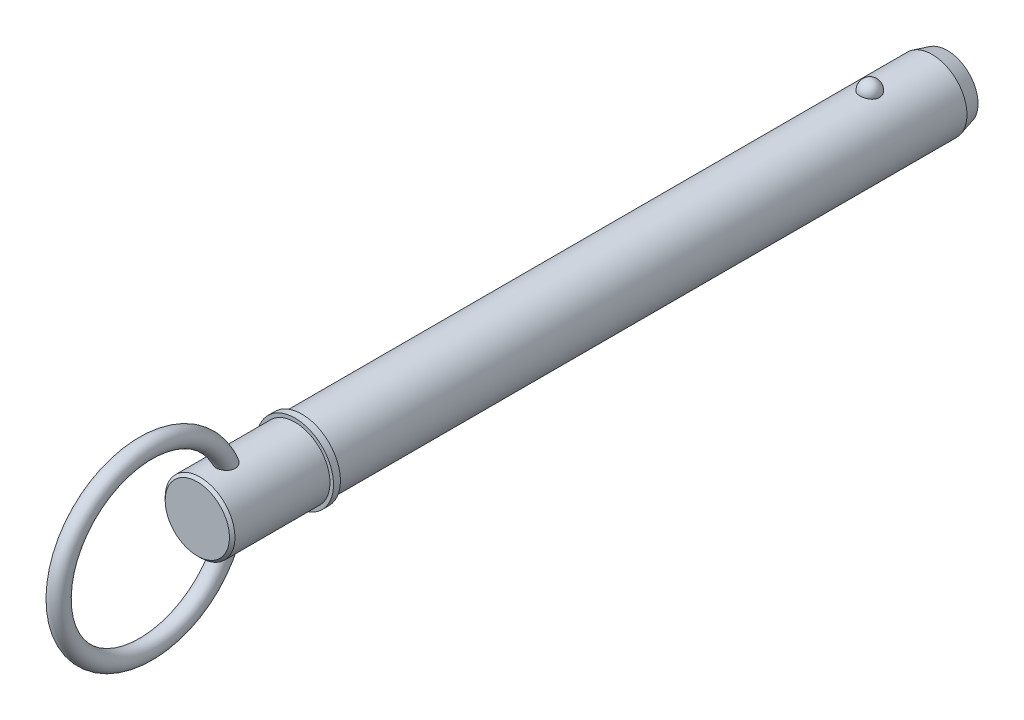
ISO-10303-21;
HEADER;
FILE_DESCRIPTION(('STEP AP214'),'2;1');
FILE_NAME('part.step','',(''),(''),'','','');
FILE_SCHEMA(('AUTOMOTIVE_DESIGN { 1 0 10303 214 1 1 1 1 }'));
ENDSEC;
DATA;
#1=APPLICATION_CONTEXT('core data for automotive mechanical design processes');
#2=APPLICATION_PROTOCOL_DEFINITION('international standard','automotive_design',2000,#1);
#3=PRODUCT_CONTEXT('',#1,'mechanical');
#4=PRODUCT('Part','Part','',(#3));
#5=PRODUCT_RELATED_PRODUCT_CATEGORY('part','',(#4));
#6=PRODUCT_DEFINITION_FORMATION('','',#4);
#7=PRODUCT_DEFINITION_CONTEXT('part definition',#1,'design');
#8=PRODUCT_DEFINITION('design','',#6,#7);
#9=PRODUCT_DEFINITION_SHAPE('','',#8);
#10=(LENGTH_UNIT() NAMED_UNIT(*) SI_UNIT(.MILLI.,.METRE.));
#11=(NAMED_UNIT(*) PLANE_ANGLE_UNIT() SI_UNIT($,.RADIAN.));
#12=(NAMED_UNIT(*) SI_UNIT($,.STERADIAN.) SOLID_ANGLE_UNIT());
#13=UNCERTAINTY_MEASURE_WITH_UNIT(LENGTH_MEASURE(1.E-05),#10,'distance_accuracy_value','');
#14=(GEOMETRIC_REPRESENTATION_CONTEXT(3) GLOBAL_UNCERTAINTY_ASSIGNED_CONTEXT((#13)) GLOBAL_UNIT_ASSIGNED_CONTEXT((#10,
#11,#12)) REPRESENTATION_CONTEXT('',''));
#15=CARTESIAN_POINT('',(0.,0.,0.));
#16=DIRECTION('',(0.,0.,1.));
#17=DIRECTION('',(1.,0.,0.));
#18=AXIS2_PLACEMENT_3D('',#15,#16,#17);
#19=CARTESIAN_POINT('',(0.,0.,203.2));
#20=DIRECTION('',(0.,0.,-1.));
#21=DIRECTION('',(-1.,0.,0.));
#22=AXIS2_PLACEMENT_3D('',#19,#20,#21);
#23=CYLINDRICAL_SURFACE('',#22,12.7);
#24=CARTESIAN_POINT('',(3.52486003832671,12.2010393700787,-3.56));
#25=CARTESIAN_POINT('',(3.52485671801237,12.2010422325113,-3.3610062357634));
#26=CARTESIAN_POINT('',(3.50863187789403,12.2057632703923,-3.16197042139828));
#27=CARTESIAN_POINT('',(3.4441205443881,12.2241207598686,-2.76953945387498));
#28=CARTESIAN_POINT('',(3.39582213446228,12.2377605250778,-2.57614642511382));
#29=CARTESIAN_POINT('',(3.26839193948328,12.2724057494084,-2.20059799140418));
#30=CARTESIAN_POINT('',(3.18927369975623,12.2934079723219,-2.01843769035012));
#31=CARTESIAN_POINT('',(3.00217139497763,12.3404306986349,-1.6703228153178));
#32=CARTESIAN_POINT('',(2.89418796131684,12.3664510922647,-1.50436788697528));
#33=CARTESIAN_POINT('',(2.65144862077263,12.4207616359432,-1.19241975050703));
#34=CARTESIAN_POINT('',(2.51656310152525,12.4490623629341,-1.04652919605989));
#35=CARTESIAN_POINT('',(2.22383249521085,12.5046678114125,-0.779711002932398));
#36=CARTESIAN_POINT('',(2.0659873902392,12.5319725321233,-0.658783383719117));
#37=CARTESIAN_POINT('',(1.73204520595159,12.5824645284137,-0.445586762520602));
#38=CARTESIAN_POINT('',(1.55600183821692,12.6056634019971,-0.353236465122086));
#39=CARTESIAN_POINT('',(1.19021695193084,12.6454411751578,-0.199381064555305));
#40=CARTESIAN_POINT('',(1.00047694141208,12.6620208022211,-0.137872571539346));
#41=CARTESIAN_POINT('',(0.616329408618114,12.6864692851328,-0.0483191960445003));
#42=CARTESIAN_POINT('',(0.422067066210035,12.6944893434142,-0.0196927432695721));
#43=CARTESIAN_POINT('',(0.0313259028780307,12.7014637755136,0.00524116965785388));
#44=CARTESIAN_POINT('',(-0.165152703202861,12.7004190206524,0.00155173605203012));
#45=CARTESIAN_POINT('',(-0.551780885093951,12.6894611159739,-0.0377454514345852));
#46=CARTESIAN_POINT('',(-0.74198078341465,12.6796749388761,-0.0728962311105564));
#47=CARTESIAN_POINT('',(-1.11361063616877,12.6524544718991,-0.173489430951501));
#48=CARTESIAN_POINT('',(-1.29504043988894,12.6350200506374,-0.238932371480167));
#49=CARTESIAN_POINT('',(-1.64521311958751,12.5942270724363,-0.398772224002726));
#50=CARTESIAN_POINT('',(-1.81387645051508,12.5708347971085,-0.493334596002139));
#51=CARTESIAN_POINT('',(-2.13292959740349,12.5206522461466,-0.708731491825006));
#52=CARTESIAN_POINT('',(-2.28331755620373,12.4938616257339,-0.829568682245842));
#53=CARTESIAN_POINT('',(-2.56470285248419,12.4391828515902,-1.0968714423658));
#54=CARTESIAN_POINT('',(-2.69527522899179,12.4112835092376,-1.24378221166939));
#55=CARTESIAN_POINT('',(-2.93023079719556,12.3579248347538,-1.55763192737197));
#56=CARTESIAN_POINT('',(-3.03461212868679,12.3324656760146,-1.72457229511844));
#57=CARTESIAN_POINT('',(-3.21564423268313,12.2865167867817,-2.07598316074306));
#58=CARTESIAN_POINT('',(-3.29196222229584,12.2660875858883,-2.26063321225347));
#59=CARTESIAN_POINT('',(-3.41323771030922,12.2328979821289,-2.64061334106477));
#60=CARTESIAN_POINT('',(-3.45819611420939,12.2201373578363,-2.83594310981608));
#61=CARTESIAN_POINT('',(-3.51550038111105,12.2037762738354,-3.2308649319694));
#62=CARTESIAN_POINT('',(-3.5279827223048,12.200137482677,-3.43043558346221));
#63=CARTESIAN_POINT('',(-3.52041430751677,12.2023234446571,-3.8289025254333));
#64=CARTESIAN_POINT('',(-3.50036443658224,12.2081479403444,-4.02779883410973));
#65=CARTESIAN_POINT('',(-3.42842010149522,12.2285446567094,-4.41824213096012));
#66=CARTESIAN_POINT('',(-3.37668525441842,12.243073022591,-4.6098208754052));
#67=CARTESIAN_POINT('',(-3.24279085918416,12.2792134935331,-4.98132360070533));
#68=CARTESIAN_POINT('',(-3.16063009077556,12.300825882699,-5.16124711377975));
#69=CARTESIAN_POINT('',(-2.96738224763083,12.3488691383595,-5.50542856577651));
#70=CARTESIAN_POINT('',(-2.85613997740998,12.3753256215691,-5.66959579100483));
#71=CARTESIAN_POINT('',(-2.60773241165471,12.4300386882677,-5.97665065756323));
#72=CARTESIAN_POINT('',(-2.47056612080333,12.458295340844,-6.11953748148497));
#73=CARTESIAN_POINT('',(-2.17327999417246,12.5135827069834,-6.38059312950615));
#74=CARTESIAN_POINT('',(-2.01307652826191,12.5406084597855,-6.49866785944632));
#75=CARTESIAN_POINT('',(-1.67442544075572,12.5902954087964,-6.70609314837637));
#76=CARTESIAN_POINT('',(-1.49597909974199,12.6129569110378,-6.79544572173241));
#77=CARTESIAN_POINT('',(-1.12819666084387,12.6511224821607,-6.94192787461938));
#78=CARTESIAN_POINT('',(-0.93902400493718,12.666712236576,-6.99944518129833));
#79=CARTESIAN_POINT('',(-0.553267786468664,12.6894125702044,-7.08227444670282));
#80=CARTESIAN_POINT('',(-0.356685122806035,12.6965241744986,-7.10759029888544));
#81=CARTESIAN_POINT('',(0.0343320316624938,12.7014305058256,-7.12510946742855));
#82=CARTESIAN_POINT('',(0.228736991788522,12.6993986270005,-7.11792901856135));
#83=CARTESIAN_POINT('',(0.613493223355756,12.6866339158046,-7.07206766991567));
#84=CARTESIAN_POINT('',(0.803844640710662,12.6759013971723,-7.03338790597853));
#85=CARTESIAN_POINT('',(1.17440741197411,12.6469443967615,-6.925834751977));
#86=CARTESIAN_POINT('',(1.35465462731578,12.6287486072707,-6.85707692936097));
#87=CARTESIAN_POINT('',(1.70092526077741,12.5867908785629,-6.69128257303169));
#88=CARTESIAN_POINT('',(1.86694777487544,12.5630285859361,-6.59424424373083));
#89=CARTESIAN_POINT('',(2.18289085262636,12.5120350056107,-6.3727748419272));
#90=CARTESIAN_POINT('',(2.33252391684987,12.4847559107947,-6.24794475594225));
#91=CARTESIAN_POINT('',(2.60889724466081,12.4299457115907,-5.97511730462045));
#92=CARTESIAN_POINT('',(2.73563353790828,12.4024145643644,-5.82711592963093));
#93=CARTESIAN_POINT('',(2.96505559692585,12.3495984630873,-5.5091226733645));
#94=CARTESIAN_POINT('',(3.06728335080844,12.3243610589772,-5.33879227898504));
#95=CARTESIAN_POINT('',(3.24218794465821,12.2795120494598,-4.98295005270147));
#96=CARTESIAN_POINT('',(3.31487538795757,12.2598984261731,-4.79744369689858));
#97=CARTESIAN_POINT('',(3.42255689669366,12.2302435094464,-4.43775244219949));
#98=CARTESIAN_POINT('',(3.46085292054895,12.2193780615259,-4.264615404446));
#99=CARTESIAN_POINT('',(3.5120056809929,12.2047747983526,-3.9143299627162));
#100=CARTESIAN_POINT('',(3.52486299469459,12.2010368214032,-3.73718164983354));
#101=CARTESIAN_POINT('',(3.52486003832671,12.2010393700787,-3.56));
#102=B_SPLINE_CURVE_WITH_KNOTS('',3,(#24,#25,#26,#27,#28,#29,#30,#31,#32,#33,#34,#35,#36,#37,
#38,#39,#40,#41,#42,#43,#44,#45,#46,#47,#48,#49,#50,#51,#52,#53,#54,#55,#56,#57,#58,#59,#60,#61,
#62,#63,#64,#65,#66,#67,#68,#69,#70,#71,#72,#73,#74,#75,#76,#77,#78,#79,#80,#81,#82,#83,#84,#85,
#86,#87,#88,#89,#90,#91,#92,#93,#94,#95,#96,#97,#98,#99,#100,#101),.UNSPECIFIED.,.T.,.F.,(4,2,2,
2,2,2,2,2,2,2,2,2,2,2,2,2,2,2,2,2,2,2,2,2,2,2,2,2,2,2,2,2,2,2,2,2,2,2,4),(0.,0.596344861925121,
1.19291141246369,1.78921606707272,2.38550767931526,2.98474477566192,3.58398233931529,
4.18149920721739,4.77895038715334,5.36566361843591,5.95232045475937,6.53059198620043,
7.10887345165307,7.6905033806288,8.27219236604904,8.86498552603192,9.45782077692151,
10.0574751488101,10.6571122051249,11.2542252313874,11.8513220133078,12.4454353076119,
13.0395724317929,13.636947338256,14.2343451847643,14.8339691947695,15.4335511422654,
16.0256602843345,16.6176978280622,17.1985559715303,17.7793931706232,18.3580179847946,
18.9366795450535,19.5242567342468,20.1119357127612,20.7098642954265,21.3075780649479,
21.8385683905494,22.3695466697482),.UNSPECIFIED.);
#103=CARTESIAN_POINT('',(3.52486003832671,12.2010393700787,-3.56));
#104=VERTEX_POINT('',#103);
#105=EDGE_CURVE('E102',#104,#104,#102,.T.);
#106=ORIENTED_EDGE('',*,*,#105,.T.);
#107=EDGE_LOOP('',(#106));
#108=FACE_BOUND('',#107,.T.);
#109=CARTESIAN_POINT('',(0.,0.,-26.2499999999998));
#110=DIRECTION('',(0.,0.,-1.));
#111=DIRECTION('',(-1.,0.,0.));
#112=AXIS2_PLACEMENT_3D('',#109,#110,#111);
#113=CIRCLE('',#112,12.7);
#114=CARTESIAN_POINT('',(-12.7,0.,-26.2499999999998));
#115=VERTEX_POINT('',#114);
#116=EDGE_CURVE('E109',#115,#115,#113,.F.);
#117=ORIENTED_EDGE('',*,*,#116,.T.);
#118=EDGE_LOOP('',(#117));
#119=FACE_BOUND('',#118,.T.);
#120=CARTESIAN_POINT('',(0.,0.,203.2));
#121=DIRECTION('',(0.,0.,1.));
#122=DIRECTION('',(1.,0.,0.));
#123=AXIS2_PLACEMENT_3D('',#120,#121,#122);
#124=CIRCLE('',#123,12.7);
#125=CARTESIAN_POINT('',(12.7,0.,203.2));
#126=VERTEX_POINT('',#125);
#127=EDGE_CURVE('E107',#126,#126,#124,.T.);
#128=ORIENTED_EDGE('',*,*,#127,.F.);
#129=EDGE_LOOP('',(#128));
#130=FACE_BOUND('',#129,.T.);
#131=ADVANCED_FACE('F39',(#108,#119,#130),#23,.T.);
#132=CARTESIAN_POINT('',(0.,0.,-31.75));
#133=DIRECTION('',(0.,0.,-1.));
#134=DIRECTION('',(-1.,0.,0.));
#135=AXIS2_PLACEMENT_3D('',#132,#133,#134);
#136=PLANE('',#135);
#137=CARTESIAN_POINT('',(0.,0.,-31.75));
#138=DIRECTION('',(0.,0.,-1.));
#139=DIRECTION('',(-1.,0.,0.));
#140=AXIS2_PLACEMENT_3D('',#137,#138,#139);
#141=CIRCLE('',#140,11.2262794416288);
#142=CARTESIAN_POINT('',(-11.2262794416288,0.,-31.75));
#143=VERTEX_POINT('',#142);
#144=EDGE_CURVE('E142',#143,#143,#141,.T.);
#145=ORIENTED_EDGE('',*,*,#144,.T.);
#146=EDGE_LOOP('',(#145));
#147=FACE_BOUND('',#146,.T.);
#148=ADVANCED_FACE('F88',(#147),#136,.T.);
#149=CARTESIAN_POINT('',(0.,0.,-31.75));
#150=DIRECTION('',(0.,0.,1.));
#151=DIRECTION('',(1.,0.,0.));
#152=AXIS2_PLACEMENT_3D('',#149,#150,#151);
#153=CONICAL_SURFACE('',#152,11.2262794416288,0.261799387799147);
#154=ORIENTED_EDGE('',*,*,#116,.F.);
#155=EDGE_LOOP('',(#154));
#156=FACE_BOUND('',#155,.T.);
#157=ORIENTED_EDGE('',*,*,#144,.F.);
#158=EDGE_LOOP('',(#157));
#159=FACE_BOUND('',#158,.T.);
#160=ADVANCED_FACE('F94',(#156,#159),#153,.T.);
#161=CARTESIAN_POINT('',(0.,12.7,-3.56));
#162=DIRECTION('',(0.,1.,0.));
#163=DIRECTION('',(0.,0.,1.));
#164=AXIS2_PLACEMENT_3D('',#161,#162,#163);
#165=SPHERICAL_SURFACE('',#164,3.56);
#166=ORIENTED_EDGE('',*,*,#105,.F.);
#167=EDGE_LOOP('',(#166));
#168=FACE_BOUND('',#167,.T.);
#169=ADVANCED_FACE('F112',(#168),#165,.T.);
#170=CARTESIAN_POINT('',(0.,0.,203.2));
#171=DIRECTION('',(0.,0.,-1.));
#172=DIRECTION('',(-1.,0.,0.));
#173=AXIS2_PLACEMENT_3D('',#170,#171,#172);
#174=PLANE('',#173);
#175=ORIENTED_EDGE('',*,*,#127,.T.);
#176=EDGE_LOOP('',(#175));
#177=FACE_BOUND('',#176,.T.);
#178=CARTESIAN_POINT('',(0.,0.,203.2));
#179=DIRECTION('',(0.,0.,-1.));
#180=DIRECTION('',(-1.,0.,0.));
#181=AXIS2_PLACEMENT_3D('',#178,#179,#180);
#182=CIRCLE('',#181,14.);
#183=CARTESIAN_POINT('',(-14.,0.,203.2));
#184=VERTEX_POINT('',#183);
#185=EDGE_CURVE('E108',#184,#184,#182,.T.);
#186=ORIENTED_EDGE('',*,*,#185,.T.);
#187=EDGE_LOOP('',(#186));
#188=FACE_BOUND('',#187,.T.);
#189=ADVANCED_FACE('F116',(#177,#188),#174,.T.);
#190=CARTESIAN_POINT('',(0.,0.,33.7287874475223));
#191=DIRECTION('',(0.,0.,-1.));
#192=DIRECTION('',(-1.,0.,0.));
#193=AXIS2_PLACEMENT_3D('',#190,#191,#192);
#194=CYLINDRICAL_SURFACE('',#193,14.);
#195=CARTESIAN_POINT('',(0.,0.,205.7));
#196=DIRECTION('',(0.,0.,-1.));
#197=DIRECTION('',(-1.,0.,0.));
#198=AXIS2_PLACEMENT_3D('',#195,#196,#197);
#199=CIRCLE('',#198,14.);
#200=CARTESIAN_POINT('',(-14.,0.,205.7));
#201=VERTEX_POINT('',#200);
#202=EDGE_CURVE('E133',#201,#201,#199,.T.);
#203=ORIENTED_EDGE('',*,*,#202,.T.);
#204=EDGE_LOOP('',(#203));
#205=FACE_BOUND('',#204,.T.);
#206=ORIENTED_EDGE('',*,*,#185,.F.);
#207=EDGE_LOOP('',(#206));
#208=FACE_BOUND('',#207,.T.);
#209=ADVANCED_FACE('F120',(#205,#208),#194,.T.);
#210=CARTESIAN_POINT('',(0.,14.,205.7));
#211=DIRECTION('',(0.,0.,1.));
#212=DIRECTION('',(1.,0.,0.));
#213=AXIS2_PLACEMENT_3D('',#210,#211,#212);
#214=PLANE('',#213);
#215=CARTESIAN_POINT('',(0.,0.,205.7));
#216=DIRECTION('',(0.,0.,1.));
#217=DIRECTION('',(1.,0.,0.));
#218=AXIS2_PLACEMENT_3D('',#215,#216,#217);
#219=CIRCLE('',#218,12.7);
#220=CARTESIAN_POINT('',(12.7,0.,205.7));
#221=VERTEX_POINT('',#220);
#222=EDGE_CURVE('E111',#221,#221,#219,.T.);
#223=ORIENTED_EDGE('',*,*,#222,.F.);
#224=EDGE_LOOP('',(#223));
#225=FACE_BOUND('',#224,.T.);
#226=ORIENTED_EDGE('',*,*,#202,.F.);
#227=EDGE_LOOP('',(#226));
#228=FACE_BOUND('',#227,.T.);
#229=ADVANCED_FACE('F85',(#225,#228),#214,.T.);
#230=CARTESIAN_POINT('',(0.,0.,241.3));
#231=DIRECTION('',(0.,0.,-1.));
#232=DIRECTION('',(-1.,0.,0.));
#233=AXIS2_PLACEMENT_3D('',#230,#231,#232);
#234=CYLINDRICAL_SURFACE('',#233,12.7);
#235=CARTESIAN_POINT('',(-1.22892607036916,-12.6404011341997,227.67119395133));
#236=CARTESIAN_POINT('',(-1.06119922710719,-12.6567092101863,227.604004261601));
#237=CARTESIAN_POINT('',(-0.887663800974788,-12.6701810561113,227.550792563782));
#238=CARTESIAN_POINT('',(-0.533823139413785,-12.6900116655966,227.473419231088));
#239=CARTESIAN_POINT('',(-0.353518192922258,-12.6963707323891,227.4492563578));
#240=CARTESIAN_POINT('',(0.0087115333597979,-12.7012887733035,227.430519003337));
#241=CARTESIAN_POINT('',(0.190636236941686,-12.699848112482,227.435943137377));
#242=CARTESIAN_POINT('',(0.5509718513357,-12.6893231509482,227.476255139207));
#243=CARTESIAN_POINT('',(0.729382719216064,-12.6802387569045,227.51114336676));
#244=CARTESIAN_POINT('',(1.0777168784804,-12.6553960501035,227.609659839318));
#245=CARTESIAN_POINT('',(1.24763507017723,-12.6396337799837,227.673305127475));
#246=CARTESIAN_POINT('',(1.57398922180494,-12.6031560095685,227.827891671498));
#247=CARTESIAN_POINT('',(1.73042571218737,-12.5824407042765,227.918831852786));
#248=CARTESIAN_POINT('',(2.02464767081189,-12.5384554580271,228.125320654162));
#249=CARTESIAN_POINT('',(2.16251370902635,-12.5151974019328,228.24075697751));
#250=CARTESIAN_POINT('',(2.41652917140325,-12.4686447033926,228.493426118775));
#251=CARTESIAN_POINT('',(2.53268123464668,-12.4453500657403,228.630656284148));
#252=CARTESIAN_POINT('',(2.7397169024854,-12.4014166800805,228.92226178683));
#253=CARTESIAN_POINT('',(2.83072997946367,-12.3807646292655,229.076543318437));
#254=CARTESIAN_POINT('',(2.98642630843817,-12.3441356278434,229.398338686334));
#255=CARTESIAN_POINT('',(3.05110876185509,-12.3281588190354,229.565852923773));
#256=CARTESIAN_POINT('',(3.15450336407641,-12.3021148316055,229.912705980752));
#257=CARTESIAN_POINT('',(3.19268116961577,-12.2921697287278,230.092212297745));
#258=CARTESIAN_POINT('',(3.24150148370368,-12.2793848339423,230.455144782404));
#259=CARTESIAN_POINT('',(3.25213515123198,-12.2765473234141,230.638572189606));
#260=CARTESIAN_POINT('',(3.24696781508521,-12.2779158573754,231.018893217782));
#261=CARTESIAN_POINT('',(3.22910261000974,-12.2826719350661,231.215753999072));
#262=CARTESIAN_POINT('',(3.16504953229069,-12.2993299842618,231.60447917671));
#263=CARTESIAN_POINT('',(3.11884966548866,-12.3112349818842,231.796341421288));
#264=CARTESIAN_POINT('',(2.99323123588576,-12.3424162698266,232.192891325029));
#265=CARTESIAN_POINT('',(2.91059577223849,-12.3623844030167,232.396505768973));
#266=CARTESIAN_POINT('',(2.71447440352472,-12.4069229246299,232.788190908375));
#267=CARTESIAN_POINT('',(2.60094970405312,-12.431499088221,232.976241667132));
#268=CARTESIAN_POINT('',(2.40499526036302,-12.4703951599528,233.247470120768));
#269=CARTESIAN_POINT('',(2.33301847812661,-12.4841083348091,233.338407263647));
#270=CARTESIAN_POINT('',(2.18106597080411,-12.5115521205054,233.513320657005));
#271=CARTESIAN_POINT('',(2.10108885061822,-12.5252827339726,233.597295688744));
#272=CARTESIAN_POINT('',(1.8497396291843,-12.5657115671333,233.836779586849));
#273=CARTESIAN_POINT('',(1.6664677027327,-12.5917488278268,233.980526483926));
#274=CARTESIAN_POINT('',(1.33551340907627,-12.6303067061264,234.185856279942));
#275=CARTESIAN_POINT('',(1.1951213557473,-12.6444898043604,234.25902243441));
#276=CARTESIAN_POINT('',(0.90394580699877,-12.6686276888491,234.381586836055));
#277=CARTESIAN_POINT('',(0.753173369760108,-12.6785868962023,234.431009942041));
#278=CARTESIAN_POINT('',(0.444090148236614,-12.6931800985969,234.502942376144));
#279=CARTESIAN_POINT('',(0.285741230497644,-12.6977833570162,234.525296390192));
#280=CARTESIAN_POINT('',(-0.0324491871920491,-12.700953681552,234.540724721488));
#281=CARTESIAN_POINT('',(-0.19229038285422,-12.6995219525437,234.533804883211));
#282=CARTESIAN_POINT('',(-0.493822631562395,-12.6912132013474,234.493209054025));
#283=CARTESIAN_POINT('',(-0.635865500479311,-12.6848307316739,234.461962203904));
#284=CARTESIAN_POINT('',(-0.913041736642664,-12.6678986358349,234.377721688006));
#285=CARTESIAN_POINT('',(-1.04817349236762,-12.6573480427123,234.324722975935));
#286=CARTESIAN_POINT('',(-1.31637898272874,-12.6323524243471,234.196233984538));
#287=CARTESIAN_POINT('',(-1.44890088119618,-12.6177203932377,234.119638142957));
#288=CARTESIAN_POINT('',(-1.70162176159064,-12.5861326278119,233.948743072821));
#289=CARTESIAN_POINT('',(-1.82181486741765,-12.569175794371,233.854435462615));
#290=CARTESIAN_POINT('',(-2.06961284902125,-12.5309682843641,233.632665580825));
#291=CARTESIAN_POINT('',(-2.19457628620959,-12.5094982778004,233.50229330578));
#292=CARTESIAN_POINT('',(-2.42503767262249,-12.4668738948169,233.225308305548));
#293=CARTESIAN_POINT('',(-2.53052086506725,-12.4457197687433,233.078683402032));
#294=CARTESIAN_POINT('',(-2.73961150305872,-12.4015349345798,232.743065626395));
#295=CARTESIAN_POINT('',(-2.83895917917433,-12.3789253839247,232.551346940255));
#296=CARTESIAN_POINT('',(-3.00725804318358,-12.3391195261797,232.154405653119));
#297=CARTESIAN_POINT('',(-3.0761885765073,-12.3219268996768,231.949173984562));
#298=CARTESIAN_POINT('',(-3.18528660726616,-12.2942052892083,231.513754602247));
#299=CARTESIAN_POINT('',(-3.22287145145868,-12.2842816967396,231.282855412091));
#300=CARTESIAN_POINT('',(-3.24821271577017,-12.2775854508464,230.934351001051));
#301=CARTESIAN_POINT('',(-3.25148236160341,-12.276719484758,230.817777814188));
#302=CARTESIAN_POINT('',(-3.24729041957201,-12.2778310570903,230.584859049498));
#303=CARTESIAN_POINT('',(-3.23983534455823,-12.2798068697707,230.468513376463));
#304=CARTESIAN_POINT('',(-3.21488959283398,-12.286359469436,230.24622762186));
#305=CARTESIAN_POINT('',(-3.19823165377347,-12.2907201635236,230.140186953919));
#306=CARTESIAN_POINT('',(-3.15537465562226,-12.3017926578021,229.93022257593));
#307=CARTESIAN_POINT('',(-3.12918076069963,-12.3085031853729,229.826297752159));
#308=CARTESIAN_POINT('',(-3.06721568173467,-12.3240904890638,229.621553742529));
#309=CARTESIAN_POINT('',(-3.0314485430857,-12.3329663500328,229.520733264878));
#310=CARTESIAN_POINT('',(-2.95042598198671,-12.3525998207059,229.323171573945));
#311=CARTESIAN_POINT('',(-2.90517160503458,-12.3633572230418,229.226429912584));
#312=CARTESIAN_POINT('',(-2.81116315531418,-12.3850478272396,229.048857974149));
#313=CARTESIAN_POINT('',(-2.76340897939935,-12.3958187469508,228.967476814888));
#314=CARTESIAN_POINT('',(-2.66091958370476,-12.4182228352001,228.809317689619));
#315=CARTESIAN_POINT('',(-2.60618212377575,-12.4298562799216,228.732541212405));
#316=CARTESIAN_POINT('',(-2.4901313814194,-12.4536239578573,228.584278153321));
#317=CARTESIAN_POINT('',(-2.42882150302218,-12.4657579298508,228.512788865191));
#318=CARTESIAN_POINT('',(-2.30002146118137,-12.4901640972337,228.375587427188));
#319=CARTESIAN_POINT('',(-2.23252894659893,-12.5024363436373,228.309877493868));
#320=CARTESIAN_POINT('',(-2.09370795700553,-12.5264205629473,228.186377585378));
#321=CARTESIAN_POINT('',(-2.02252382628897,-12.5381388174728,228.128426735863));
#322=CARTESIAN_POINT('',(-1.87531735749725,-12.5610012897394,228.01889123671));
#323=CARTESIAN_POINT('',(-1.79929316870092,-12.5721452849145,227.967309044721));
#324=CARTESIAN_POINT('',(-1.56485282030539,-12.6042047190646,227.822706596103));
#325=CARTESIAN_POINT('',(-1.39990754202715,-12.6237766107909,227.739687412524));
#326=CARTESIAN_POINT('',(-1.22892607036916,-12.6404011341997,227.67119395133));
#327=B_SPLINE_CURVE_WITH_KNOTS('',3,(#235,#236,#237,#238,#239,#240,#241,#242,#243,#244,#245,
#246,#247,#248,#249,#250,#251,#252,#253,#254,#255,#256,#257,#258,#259,#260,#261,#262,#263,#264,
#265,#266,#267,#268,#269,#270,#271,#272,#273,#274,#275,#276,#277,#278,#279,#280,#281,#282,#283,
#284,#285,#286,#287,#288,#289,#290,#291,#292,#293,#294,#295,#296,#297,#298,#299,#300,#301,#302,
#303,#304,#305,#306,#307,#308,#309,#310,#311,#312,#313,#314,#315,#316,#317,#318,#319,#320,#321,
#322,#323,#324,#325,#326),.UNSPECIFIED.,.T.,.F.,(4,2,2,2,2,2,2,2,2,2,2,2,2,2,2,2,2,2,2,2,2,2,2,
2,2,2,2,2,2,2,2,2,2,2,2,2,2,2,2,2,2,2,2,2,2,4),(0.,0.543509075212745,1.08699497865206,
1.63045544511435,2.17392254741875,2.71771216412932,3.26148037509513,3.80280767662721,
4.34406914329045,4.88248866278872,5.42092451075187,5.9699227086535,6.51909710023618,
7.10988630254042,7.70092576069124,8.36013748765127,9.02018098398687,9.3700914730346,
9.72006308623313,10.4175255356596,10.8925536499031,11.3670833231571,11.844322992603,
12.3214673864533,12.7562647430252,13.1911630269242,13.6507378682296,14.110530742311,
14.6541210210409,15.198121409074,15.8467121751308,16.4957426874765,17.1940750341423,
17.5435132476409,17.8927393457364,18.2145822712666,18.536251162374,18.8577843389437,
19.1792821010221,19.4638320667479,19.7484735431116,20.0329683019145,20.3175717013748,
20.5948148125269,20.8721645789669,21.4262200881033),.UNSPECIFIED.);
#328=CARTESIAN_POINT('',(-1.22892607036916,-12.6404011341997,227.67119395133));
#329=VERTEX_POINT('',#328);
#330=EDGE_CURVE('E10',#329,#329,#327,.T.);
#331=ORIENTED_EDGE('',*,*,#330,.F.);
#332=EDGE_LOOP('',(#331));
#333=FACE_BOUND('',#332,.T.);
#334=CARTESIAN_POINT('',(-1.22892607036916,12.6404011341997,227.67119395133));
#335=CARTESIAN_POINT('',(-1.39512541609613,12.624240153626,227.73776712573));
#336=CARTESIAN_POINT('',(-1.55582432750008,12.6052778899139,227.818153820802));
#337=CARTESIAN_POINT('',(-1.86136954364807,12.5638060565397,228.004658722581));
#338=CARTESIAN_POINT('',(-2.00617769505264,12.5412882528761,228.110836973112));
#339=CARTESIAN_POINT('',(-2.27547906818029,12.4952333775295,228.346103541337));
#340=CARTESIAN_POINT('',(-2.3999874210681,12.4716970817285,228.475174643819));
#341=CARTESIAN_POINT('',(-2.62534229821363,12.4262157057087,228.752623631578));
#342=CARTESIAN_POINT('',(-2.72620384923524,12.4042696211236,228.900989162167));
#343=CARTESIAN_POINT('',(-2.90197976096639,12.3643304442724,229.2126750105));
#344=CARTESIAN_POINT('',(-2.97691335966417,12.346334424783,229.375984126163));
#345=CARTESIAN_POINT('',(-3.09983588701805,12.3160482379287,229.712927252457));
#346=CARTESIAN_POINT('',(-3.14781852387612,12.3037594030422,229.886563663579));
#347=CARTESIAN_POINT('',(-3.21809353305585,12.2855709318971,230.245523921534));
#348=CARTESIAN_POINT('',(-3.23943500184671,12.2799082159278,230.431044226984));
#349=CARTESIAN_POINT('',(-3.2544382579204,12.2759385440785,230.803232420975));
#350=CARTESIAN_POINT('',(-3.24809142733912,12.2776338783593,230.989900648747));
#351=CARTESIAN_POINT('',(-3.20755159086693,12.288291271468,231.377577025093));
#352=CARTESIAN_POINT('',(-3.17081691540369,12.2979162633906,231.578299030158));
#353=CARTESIAN_POINT('',(-3.06845850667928,12.3238513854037,231.971858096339));
#354=CARTESIAN_POINT('',(-3.00281105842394,12.3401670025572,232.164688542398));
#355=CARTESIAN_POINT('',(-2.83560995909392,12.3797223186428,232.559473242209));
#356=CARTESIAN_POINT('',(-2.73085133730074,12.4035339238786,232.760019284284));
#357=CARTESIAN_POINT('',(-2.48976141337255,12.4541651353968,233.140813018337));
#358=CARTESIAN_POINT('',(-2.35343772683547,12.4809840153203,233.321065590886));
#359=CARTESIAN_POINT('',(-2.07683984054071,12.5296806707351,233.62565995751));
#360=CARTESIAN_POINT('',(-1.94129351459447,12.551613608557,233.754283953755));
#361=CARTESIAN_POINT('',(-1.65081707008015,12.5931023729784,233.987836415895));
#362=CARTESIAN_POINT('',(-1.49591505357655,12.6126615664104,234.092798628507));
#363=CARTESIAN_POINT('',(-1.19690065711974,12.6442092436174,234.257788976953));
#364=CARTESIAN_POINT('',(-1.0554126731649,12.6569190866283,234.322418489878));
#365=CARTESIAN_POINT('',(-0.76341583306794,12.6778764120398,234.427638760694));
#366=CARTESIAN_POINT('',(-0.612913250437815,12.6861269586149,234.468246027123));
#367=CARTESIAN_POINT('',(-0.306168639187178,12.697239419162,234.522715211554));
#368=CARTESIAN_POINT('',(-0.149903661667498,12.7000767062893,234.536454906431));
#369=CARTESIAN_POINT('',(0.16255262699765,12.699920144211,234.53569423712));
#370=CARTESIAN_POINT('',(0.318743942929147,12.6969267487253,234.521196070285));
#371=CARTESIAN_POINT('',(0.614555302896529,12.6859231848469,234.467234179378));
#372=CARTESIAN_POINT('',(0.754548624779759,12.6782987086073,234.429687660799));
#373=CARTESIAN_POINT('',(1.0268504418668,12.6591561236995,234.333711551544));
#374=CARTESIAN_POINT('',(1.15915690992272,12.6476369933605,234.275276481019));
#375=CARTESIAN_POINT('',(1.42405861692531,12.6206654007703,234.134988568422));
#376=CARTESIAN_POINT('',(1.5558287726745,12.604971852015,234.051635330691));
#377=CARTESIAN_POINT('',(1.80621935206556,12.571537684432,233.867498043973));
#378=CARTESIAN_POINT('',(1.92483289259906,12.5537960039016,233.766704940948));
#379=CARTESIAN_POINT('',(2.16936918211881,12.5140714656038,233.530174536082));
#380=CARTESIAN_POINT('',(2.29236422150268,12.4919255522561,233.391439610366));
#381=CARTESIAN_POINT('',(2.5176248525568,12.4484835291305,233.097913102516));
#382=CARTESIAN_POINT('',(2.61987416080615,12.4271880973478,232.943109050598));
#383=CARTESIAN_POINT('',(2.81956306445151,12.3835520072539,232.591316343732));
#384=CARTESIAN_POINT('',(2.91268031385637,12.3617361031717,232.391798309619));
#385=CARTESIAN_POINT('',(3.06675738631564,12.3244204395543,231.979898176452));
#386=CARTESIAN_POINT('',(3.12769905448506,12.3089242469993,231.767508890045));
#387=CARTESIAN_POINT('',(3.19410612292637,12.2917937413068,231.437729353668));
#388=CARTESIAN_POINT('',(3.21217746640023,12.2870696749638,231.322917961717));
#389=CARTESIAN_POINT('',(3.23822570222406,12.2802317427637,231.092095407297));
#390=CARTESIAN_POINT('',(3.24620727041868,12.2781166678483,230.97608482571));
#391=CARTESIAN_POINT('',(3.25166839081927,12.2766712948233,230.74381042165));
#392=CARTESIAN_POINT('',(3.24914931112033,12.2773406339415,230.627546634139));
#393=CARTESIAN_POINT('',(3.23325304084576,12.2815367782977,230.395869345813));
#394=CARTESIAN_POINT('',(3.2198826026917,12.2850618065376,230.28045536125));
#395=CARTESIAN_POINT('',(3.18378347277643,12.2944635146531,230.062188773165));
#396=CARTESIAN_POINT('',(3.16203615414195,12.3000921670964,229.959162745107));
#397=CARTESIAN_POINT('',(3.10931056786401,12.3135262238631,229.755694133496));
#398=CARTESIAN_POINT('',(3.0783372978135,12.3213304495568,229.65525018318));
#399=CARTESIAN_POINT('',(3.00719503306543,12.3388864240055,229.457882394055));
#400=CARTESIAN_POINT('',(2.96702904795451,12.34863753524,229.360957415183));
#401=CARTESIAN_POINT('',(2.87766260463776,12.3697681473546,229.17155308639));
#402=CARTESIAN_POINT('',(2.82846300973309,12.3811474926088,229.079073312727));
#403=CARTESIAN_POINT('',(2.72718770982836,12.4038233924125,228.909278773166));
#404=CARTESIAN_POINT('',(2.67601025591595,12.4149937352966,228.831409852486));
#405=CARTESIAN_POINT('',(2.56702778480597,12.4379850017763,228.680514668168));
#406=CARTESIAN_POINT('',(2.50922051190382,12.4498061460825,228.607490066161));
#407=CARTESIAN_POINT('',(2.3874143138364,12.4737362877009,228.466915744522));
#408=CARTESIAN_POINT('',(2.32341881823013,12.4858451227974,228.399363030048));
#409=CARTESIAN_POINT('',(2.18967865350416,12.5099935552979,228.270183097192));
#410=CARTESIAN_POINT('',(2.11993188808,12.5220331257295,228.208558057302));
#411=CARTESIAN_POINT('',(1.90863625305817,12.5565453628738,228.037971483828));
#412=CARTESIAN_POINT('',(1.75996750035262,12.5784460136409,227.937508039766));
#413=CARTESIAN_POINT('',(1.44761854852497,12.6182083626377,227.762748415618));
#414=CARTESIAN_POINT('',(1.28394037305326,12.6360706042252,227.688448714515));
#415=CARTESIAN_POINT('',(0.94588781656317,12.6658634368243,227.567537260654));
#416=CARTESIAN_POINT('',(0.771499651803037,12.6777861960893,227.520962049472));
#417=CARTESIAN_POINT('',(0.417041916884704,12.694390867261,227.456673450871));
#418=CARTESIAN_POINT('',(0.236969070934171,12.6990685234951,227.438977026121));
#419=CARTESIAN_POINT('',(-0.124879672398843,12.7006841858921,227.432829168));
#420=CARTESIAN_POINT('',(-0.306658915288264,12.6975703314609,227.444573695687));
#421=CARTESIAN_POINT('',(-0.665297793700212,12.6838264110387,227.497473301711));
#422=CARTESIAN_POINT('',(-0.842168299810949,12.6732146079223,227.538556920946));
#423=CARTESIAN_POINT('',(-1.0502551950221,12.6565519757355,227.605394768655));
#424=CARTESIAN_POINT('',(-1.08632235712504,12.6535053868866,227.617681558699));
#425=CARTESIAN_POINT('',(-1.15798463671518,12.6471484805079,227.643501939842));
#426=CARTESIAN_POINT('',(-1.19357974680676,12.643838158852,227.65703555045));
#427=CARTESIAN_POINT('',(-1.22892607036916,12.6404011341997,227.67119395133));
#428=B_SPLINE_CURVE_WITH_KNOTS('',3,(#334,#335,#336,#337,#338,#339,#340,#341,#342,#343,#344,
#345,#346,#347,#348,#349,#350,#351,#352,#353,#354,#355,#356,#357,#358,#359,#360,#361,#362,#363,
#364,#365,#366,#367,#368,#369,#370,#371,#372,#373,#374,#375,#376,#377,#378,#379,#380,#381,#382,
#383,#384,#385,#386,#387,#388,#389,#390,#391,#392,#393,#394,#395,#396,#397,#398,#399,#400,#401,
#402,#403,#404,#405,#406,#407,#408,#409,#410,#411,#412,#413,#414,#415,#416,#417,#418,#419,#420,
#421,#422,#423,#424,#425,#426,#427),.UNSPECIFIED.,.T.,.F.,(4,2,2,2,2,2,2,2,2,2,2,2,2,2,2,2,2,2,
2,2,2,2,2,2,2,2,2,2,2,2,2,2,2,2,2,2,2,2,2,2,2,2,2,2,2,2,4),(0.,0.539146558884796,
1.07956050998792,1.6195697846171,2.15923496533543,2.69849886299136,3.23788860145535,
3.79602631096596,4.3543377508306,4.96471598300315,5.57559579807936,6.2550948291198,
6.93443009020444,7.4967142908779,8.05819140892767,8.52445959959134,8.99040698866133,
9.45846913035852,9.92649485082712,10.3600530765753,10.7937251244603,11.2621204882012,
11.7307597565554,12.2888675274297,12.8474116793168,13.5084064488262,14.1697737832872,
14.5183408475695,14.8667463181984,15.2151063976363,15.5632498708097,15.8791508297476,
16.1948809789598,16.5105079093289,16.826104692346,17.1072964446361,17.3885841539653,
17.669716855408,17.9509524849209,18.490448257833,19.0298713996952,19.5700039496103,
20.1104536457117,20.6545101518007,21.1972460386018,21.3119068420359,21.4265694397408),.UNSPECIFIED.);
#429=CARTESIAN_POINT('',(-1.22892607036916,12.6404011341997,227.67119395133));
#430=VERTEX_POINT('',#429);
#431=EDGE_CURVE('E51',#430,#430,#428,.T.);
#432=ORIENTED_EDGE('',*,*,#431,.F.);
#433=EDGE_LOOP('',(#432));
#434=FACE_BOUND('',#433,.T.);
#435=CARTESIAN_POINT('',(0.,0.,240.3));
#436=DIRECTION('',(0.,0.,-1.));
#437=DIRECTION('',(-1.,0.,0.));
#438=AXIS2_PLACEMENT_3D('',#435,#436,#437);
#439=CIRCLE('',#438,12.7);
#440=CARTESIAN_POINT('',(-12.7,0.,240.3));
#441=VERTEX_POINT('',#440);
#442=EDGE_CURVE('E64',#441,#441,#439,.T.);
#443=ORIENTED_EDGE('',*,*,#442,.T.);
#444=EDGE_LOOP('',(#443));
#445=FACE_BOUND('',#444,.T.);
#446=ORIENTED_EDGE('',*,*,#222,.T.);
#447=EDGE_LOOP('',(#446));
#448=FACE_BOUND('',#447,.T.);
#449=ADVANCED_FACE('F69',(#333,#434,#445,#448),#234,.T.);
#450=CARTESIAN_POINT('',(0.,0.,241.3));
#451=DIRECTION('',(0.,0.,-1.));
#452=DIRECTION('',(-1.,0.,0.));
#453=AXIS2_PLACEMENT_3D('',#450,#451,#452);
#454=PLANE('',#453);
#455=CARTESIAN_POINT('',(0.,0.,241.3));
#456=DIRECTION('',(0.,0.,-1.));
#457=DIRECTION('',(-1.,0.,0.));
#458=AXIS2_PLACEMENT_3D('',#455,#456,#457);
#459=CIRCLE('',#458,11.6999999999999);
#460=CARTESIAN_POINT('',(-11.6999999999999,0.,241.3));
#461=VERTEX_POINT('',#460);
#462=EDGE_CURVE('E58',#461,#461,#459,.F.);
#463=ORIENTED_EDGE('',*,*,#462,.T.);
#464=EDGE_LOOP('',(#463));
#465=FACE_BOUND('',#464,.T.);
#466=ADVANCED_FACE('F76',(#465),#454,.F.);
#467=CARTESIAN_POINT('',(0.,0.,240.3));
#468=DIRECTION('',(0.,0.,-1.));
#469=DIRECTION('',(-1.,0.,0.));
#470=AXIS2_PLACEMENT_3D('',#467,#468,#469);
#471=CONICAL_SURFACE('',#470,12.7,0.785398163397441);
#472=ORIENTED_EDGE('',*,*,#462,.F.);
#473=EDGE_LOOP('',(#472));
#474=FACE_BOUND('',#473,.T.);
#475=ORIENTED_EDGE('',*,*,#442,.F.);
#476=EDGE_LOOP('',(#475));
#477=FACE_BOUND('',#476,.T.);
#478=ADVANCED_FACE('F41',(#474,#477),#471,.T.);
#479=CARTESIAN_POINT('',(0.,0.,260.05));
#480=DIRECTION('',(1.,0.,0.));
#481=DIRECTION('',(0.,0.,-1.));
#482=AXIS2_PLACEMENT_3D('',#479,#480,#481);
#483=TOROIDAL_SURFACE('',#482,31.75,3.25);
#484=ORIENTED_EDGE('',*,*,#330,.T.);
#485=EDGE_LOOP('',(#484));
#486=FACE_BOUND('',#485,.T.);
#487=ORIENTED_EDGE('',*,*,#431,.T.);
#488=EDGE_LOOP('',(#487));
#489=FACE_BOUND('',#488,.T.);
#490=ADVANCED_FACE('F73',(#486,#489),#483,.T.);
#491=CLOSED_SHELL('',(#131,#148,#160,#169,#189,#209,#229,#449,#466,#478,#490));
#492=MANIFOLD_SOLID_BREP('B2',#491);
#493=ADVANCED_BREP_SHAPE_REPRESENTATION('',(#18,#492),#14);
#494=SHAPE_DEFINITION_REPRESENTATION(#9,#493);
ENDSEC;
END-ISO-10303-21;
